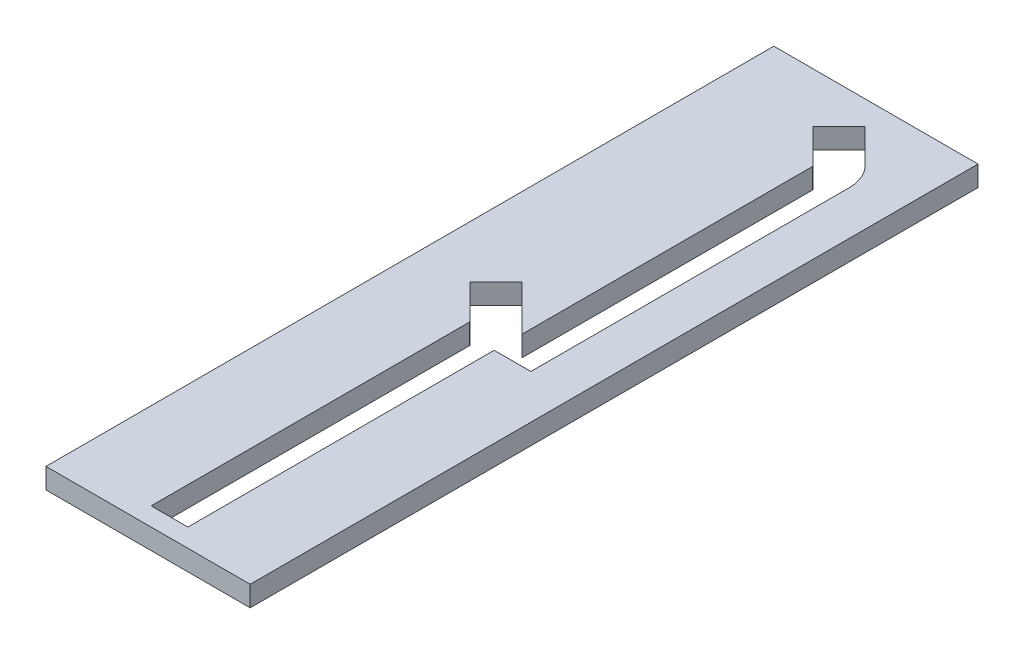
ISO-10303-21;
HEADER;
FILE_DESCRIPTION(('STEP AP214'),'2;1');
FILE_NAME('part.step','',(''),(''),'','','');
FILE_SCHEMA(('AUTOMOTIVE_DESIGN { 1 0 10303 214 1 1 1 1 }'));
ENDSEC;
DATA;
#1=APPLICATION_CONTEXT('core data for automotive mechanical design processes');
#2=APPLICATION_PROTOCOL_DEFINITION('international standard','automotive_design',2000,#1);
#3=PRODUCT_CONTEXT('',#1,'mechanical');
#4=PRODUCT('Part','Part','',(#3));
#5=PRODUCT_RELATED_PRODUCT_CATEGORY('part','',(#4));
#6=PRODUCT_DEFINITION_FORMATION('','',#4);
#7=PRODUCT_DEFINITION_CONTEXT('part definition',#1,'design');
#8=PRODUCT_DEFINITION('design','',#6,#7);
#9=PRODUCT_DEFINITION_SHAPE('','',#8);
#10=(LENGTH_UNIT() NAMED_UNIT(*) SI_UNIT(.MILLI.,.METRE.));
#11=(NAMED_UNIT(*) PLANE_ANGLE_UNIT() SI_UNIT($,.RADIAN.));
#12=(NAMED_UNIT(*) SI_UNIT($,.STERADIAN.) SOLID_ANGLE_UNIT());
#13=UNCERTAINTY_MEASURE_WITH_UNIT(LENGTH_MEASURE(1.E-05),#10,'distance_accuracy_value','');
#14=(GEOMETRIC_REPRESENTATION_CONTEXT(3) GLOBAL_UNCERTAINTY_ASSIGNED_CONTEXT((#13)) GLOBAL_UNIT_ASSIGNED_CONTEXT((#10,
#11,#12)) REPRESENTATION_CONTEXT('',''));
#15=CARTESIAN_POINT('',(0.,0.,0.));
#16=DIRECTION('',(0.,0.,1.));
#17=DIRECTION('',(1.,0.,0.));
#18=AXIS2_PLACEMENT_3D('',#15,#16,#17);
#19=CARTESIAN_POINT('',(0.,0.,0.));
#20=DIRECTION('',(0.,0.,1.));
#21=DIRECTION('',(1.,0.,0.));
#22=AXIS2_PLACEMENT_3D('',#19,#20,#21);
#23=PLANE('',#22);
#24=DIRECTION('',(1.,0.,0.));
#25=VECTOR('',#24,1.);
#26=CARTESIAN_POINT('',(-100.,-10.,0.));
#27=LINE('',#26,#25);
#28=CARTESIAN_POINT('',(-100.,-10.,0.));
#29=VERTEX_POINT('',#28);
#30=CARTESIAN_POINT('',(100.,-10.,0.));
#31=VERTEX_POINT('',#30);
#32=EDGE_CURVE('E9',#29,#31,#27,.T.);
#33=ORIENTED_EDGE('',*,*,#32,.T.);
#34=DIRECTION('',(0.,1.,0.));
#35=VECTOR('',#34,1.);
#36=CARTESIAN_POINT('',(100.,-10.,0.));
#37=LINE('',#36,#35);
#38=CARTESIAN_POINT('',(100.,10.,0.));
#39=VERTEX_POINT('',#38);
#40=EDGE_CURVE('E239',#31,#39,#37,.T.);
#41=ORIENTED_EDGE('',*,*,#40,.T.);
#42=DIRECTION('',(-1.,0.,0.));
#43=VECTOR('',#42,1.);
#44=CARTESIAN_POINT('',(100.,10.,0.));
#45=LINE('',#44,#43);
#46=CARTESIAN_POINT('',(-100.,10.,0.));
#47=VERTEX_POINT('',#46);
#48=EDGE_CURVE('E386',#39,#47,#45,.T.);
#49=ORIENTED_EDGE('',*,*,#48,.T.);
#50=DIRECTION('',(0.,-1.,0.));
#51=VECTOR('',#50,1.);
#52=CARTESIAN_POINT('',(-100.,10.,0.));
#53=LINE('',#52,#51);
#54=EDGE_CURVE('E391',#47,#29,#53,.T.);
#55=ORIENTED_EDGE('',*,*,#54,.T.);
#56=EDGE_LOOP('',(#33,#41,#49,#55));
#57=FACE_BOUND('',#56,.T.);
#58=ADVANCED_FACE('F15',(#57),#23,.T.);
#59=CARTESIAN_POINT('',(0.,0.,-713.));
#60=DIRECTION('',(0.,0.,1.));
#61=DIRECTION('',(1.,0.,0.));
#62=AXIS2_PLACEMENT_3D('',#59,#60,#61);
#63=PLANE('',#62);
#64=DIRECTION('',(0.,1.,0.));
#65=VECTOR('',#64,1.);
#66=CARTESIAN_POINT('',(100.,-10.,-713.));
#67=LINE('',#66,#65);
#68=CARTESIAN_POINT('',(100.,-10.,-713.));
#69=VERTEX_POINT('',#68);
#70=CARTESIAN_POINT('',(100.,10.,-713.));
#71=VERTEX_POINT('',#70);
#72=EDGE_CURVE('E198',#69,#71,#67,.T.);
#73=ORIENTED_EDGE('',*,*,#72,.F.);
#74=DIRECTION('',(1.,0.,0.));
#75=VECTOR('',#74,1.);
#76=CARTESIAN_POINT('',(-100.,-10.,-713.));
#77=LINE('',#76,#75);
#78=CARTESIAN_POINT('',(-100.,-10.,-713.));
#79=VERTEX_POINT('',#78);
#80=EDGE_CURVE('E23',#79,#69,#77,.T.);
#81=ORIENTED_EDGE('',*,*,#80,.F.);
#82=DIRECTION('',(0.,-1.,0.));
#83=VECTOR('',#82,1.);
#84=CARTESIAN_POINT('',(-100.,10.,-713.));
#85=LINE('',#84,#83);
#86=CARTESIAN_POINT('',(-100.,10.,-713.));
#87=VERTEX_POINT('',#86);
#88=EDGE_CURVE('E390',#87,#79,#85,.T.);
#89=ORIENTED_EDGE('',*,*,#88,.F.);
#90=DIRECTION('',(-1.,0.,0.));
#91=VECTOR('',#90,1.);
#92=CARTESIAN_POINT('',(100.,10.,-713.));
#93=LINE('',#92,#91);
#94=EDGE_CURVE('E238',#71,#87,#93,.T.);
#95=ORIENTED_EDGE('',*,*,#94,.F.);
#96=EDGE_LOOP('',(#73,#81,#89,#95));
#97=FACE_BOUND('',#96,.T.);
#98=ADVANCED_FACE('F408',(#97),#63,.F.);
#99=CARTESIAN_POINT('',(-100.,-10.,0.));
#100=DIRECTION('',(0.,-1.,0.));
#101=DIRECTION('',(0.,0.,-1.));
#102=AXIS2_PLACEMENT_3D('',#99,#100,#101);
#103=PLANE('',#102);
#104=CARTESIAN_POINT('',(19.,-10.,-629.715728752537));
#105=DIRECTION('',(0.,1.,0.));
#106=DIRECTION('',(-1.,0.,0.));
#107=AXIS2_PLACEMENT_3D('',#104,#105,#106);
#108=CIRCLE('',#107,38.);
#109=CARTESIAN_POINT('',(57.,-10.,-629.715728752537));
#110=VERTEX_POINT('',#109);
#111=CARTESIAN_POINT('',(45.8700576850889,-10.,-656.585786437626));
#112=VERTEX_POINT('',#111);
#113=EDGE_CURVE('E262',#110,#112,#108,.T.);
#114=ORIENTED_EDGE('',*,*,#113,.T.);
#115=DIRECTION('',(-0.707106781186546,0.,-0.707106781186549));
#116=VECTOR('',#115,1.);
#117=CARTESIAN_POINT('',(45.8700576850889,-10.,-656.585786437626));
#118=LINE('',#117,#116);
#119=CARTESIAN_POINT('',(12.8370490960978,-10.,-689.618795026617));
#120=VERTEX_POINT('',#119);
#121=EDGE_CURVE('E298',#112,#120,#118,.T.);
#122=ORIENTED_EDGE('',*,*,#121,.T.);
#123=DIRECTION('',(-0.707106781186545,0.,0.70710678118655));
#124=VECTOR('',#123,1.);
#125=CARTESIAN_POINT('',(12.8370490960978,-10.,-689.618795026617));
#126=LINE('',#125,#124);
#127=CARTESIAN_POINT('',(-12.6187950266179,-10.,-664.162950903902));
#128=VERTEX_POINT('',#127);
#129=EDGE_CURVE('E338',#120,#128,#126,.T.);
#130=ORIENTED_EDGE('',*,*,#129,.T.);
#131=DIRECTION('',(0.707106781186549,0.,0.707106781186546));
#132=VECTOR('',#131,1.);
#133=CARTESIAN_POINT('',(-12.6187950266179,-10.,-664.162950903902));
#134=LINE('',#133,#132);
#135=CARTESIAN_POINT('',(20.4142135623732,-10.,-631.12994231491));
#136=VERTEX_POINT('',#135);
#137=EDGE_CURVE('E276',#128,#136,#134,.T.);
#138=ORIENTED_EDGE('',*,*,#137,.T.);
#139=CARTESIAN_POINT('',(19.,-10.,-629.715728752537));
#140=DIRECTION('',(0.,-1.,0.));
#141=DIRECTION('',(1.,0.,0.));
#142=AXIS2_PLACEMENT_3D('',#139,#140,#141);
#143=CIRCLE('',#142,2.);
#144=CARTESIAN_POINT('',(21.,-10.,-629.715728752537));
#145=VERTEX_POINT('',#144);
#146=EDGE_CURVE('E330',#136,#145,#143,.T.);
#147=ORIENTED_EDGE('',*,*,#146,.T.);
#148=DIRECTION('',(0.,0.,1.));
#149=VECTOR('',#148,1.);
#150=CARTESIAN_POINT('',(21.,-10.,-629.715728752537));
#151=LINE('',#150,#149);
#152=CARTESIAN_POINT('',(21.,-10.,-345.455844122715));
#153=VERTEX_POINT('',#152);
#154=EDGE_CURVE('E356',#145,#153,#151,.T.);
#155=ORIENTED_EDGE('',*,*,#154,.T.);
#156=DIRECTION('',(-0.707106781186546,0.,-0.707106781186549));
#157=VECTOR('',#156,1.);
#158=CARTESIAN_POINT('',(21.,-10.,-345.455844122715));
#159=LINE('',#158,#157);
#160=CARTESIAN_POINT('',(-23.1629509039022,-10.,-389.618795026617));
#161=VERTEX_POINT('',#160);
#162=EDGE_CURVE('E367',#153,#161,#159,.T.);
#163=ORIENTED_EDGE('',*,*,#162,.T.);
#164=DIRECTION('',(-0.707106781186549,0.,0.707106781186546));
#165=VECTOR('',#164,1.);
#166=CARTESIAN_POINT('',(-23.1629509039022,-10.,-389.618795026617));
#167=LINE('',#166,#165);
#168=CARTESIAN_POINT('',(-48.618795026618,-10.,-364.162950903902));
#169=VERTEX_POINT('',#168);
#170=EDGE_CURVE('E199',#161,#169,#167,.T.);
#171=ORIENTED_EDGE('',*,*,#170,.T.);
#172=DIRECTION('',(0.707106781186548,0.,0.707106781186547));
#173=VECTOR('',#172,1.);
#174=CARTESIAN_POINT('',(-48.618795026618,-10.,-364.162950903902));
#175=LINE('',#174,#173);
#176=CARTESIAN_POINT('',(-15.5857864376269,-10.,-331.129942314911));
#177=VERTEX_POINT('',#176);
#178=EDGE_CURVE('E215',#169,#177,#175,.T.);
#179=ORIENTED_EDGE('',*,*,#178,.T.);
#180=CARTESIAN_POINT('',(-17.,-10.,-329.715728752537));
#181=DIRECTION('',(0.,-1.,0.));
#182=DIRECTION('',(1.,0.,0.));
#183=AXIS2_PLACEMENT_3D('',#180,#181,#182);
#184=CIRCLE('',#183,2.);
#185=CARTESIAN_POINT('',(-15.,-10.,-329.715728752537));
#186=VERTEX_POINT('',#185);
#187=EDGE_CURVE('E234',#177,#186,#184,.T.);
#188=ORIENTED_EDGE('',*,*,#187,.T.);
#189=DIRECTION('',(0.,0.,1.));
#190=VECTOR('',#189,1.);
#191=CARTESIAN_POINT('',(-15.,-10.,-329.715728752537));
#192=LINE('',#191,#190);
#193=CARTESIAN_POINT('',(-15.,-10.,-18.));
#194=VERTEX_POINT('',#193);
#195=EDGE_CURVE('E252',#186,#194,#192,.T.);
#196=ORIENTED_EDGE('',*,*,#195,.T.);
#197=DIRECTION('',(1.,0.,0.));
#198=VECTOR('',#197,1.);
#199=CARTESIAN_POINT('',(-15.,-10.,-18.));
#200=LINE('',#199,#198);
#201=CARTESIAN_POINT('',(21.,-10.,-18.));
#202=VERTEX_POINT('',#201);
#203=EDGE_CURVE('E261',#194,#202,#200,.T.);
#204=ORIENTED_EDGE('',*,*,#203,.T.);
#205=DIRECTION('',(0.,0.,-1.));
#206=VECTOR('',#205,1.);
#207=CARTESIAN_POINT('',(21.,-10.,-18.));
#208=LINE('',#207,#206);
#209=CARTESIAN_POINT('',(21.,-10.,-318.));
#210=VERTEX_POINT('',#209);
#211=EDGE_CURVE('E284',#202,#210,#208,.T.);
#212=ORIENTED_EDGE('',*,*,#211,.T.);
#213=DIRECTION('',(1.,0.,0.));
#214=VECTOR('',#213,1.);
#215=CARTESIAN_POINT('',(21.,-10.,-318.));
#216=LINE('',#215,#214);
#217=CARTESIAN_POINT('',(57.,-10.,-318.));
#218=VERTEX_POINT('',#217);
#219=EDGE_CURVE('E241',#210,#218,#216,.T.);
#220=ORIENTED_EDGE('',*,*,#219,.T.);
#221=DIRECTION('',(0.,0.,-1.));
#222=VECTOR('',#221,1.);
#223=CARTESIAN_POINT('',(57.,-10.,-318.));
#224=LINE('',#223,#222);
#225=EDGE_CURVE('E229',#218,#110,#224,.T.);
#226=ORIENTED_EDGE('',*,*,#225,.T.);
#227=EDGE_LOOP('',(#114,#122,#130,#138,#147,#155,#163,#171,#179,#188,#196,#204,#212,#220,#226));
#228=FACE_BOUND('',#227,.T.);
#229=ORIENTED_EDGE('',*,*,#80,.T.);
#230=DIRECTION('',(0.,0.,-1.));
#231=VECTOR('',#230,1.);
#232=CARTESIAN_POINT('',(100.,-10.,0.));
#233=LINE('',#232,#231);
#234=EDGE_CURVE('E235',#31,#69,#233,.T.);
#235=ORIENTED_EDGE('',*,*,#234,.F.);
#236=ORIENTED_EDGE('',*,*,#32,.F.);
#237=DIRECTION('',(0.,0.,-1.));
#238=VECTOR('',#237,1.);
#239=CARTESIAN_POINT('',(-100.,-10.,0.));
#240=LINE('',#239,#238);
#241=EDGE_CURVE('E394',#29,#79,#240,.T.);
#242=ORIENTED_EDGE('',*,*,#241,.T.);
#243=EDGE_LOOP('',(#229,#235,#236,#242));
#244=FACE_BOUND('',#243,.T.);
#245=ADVANCED_FACE('F402',(#228,#244),#103,.T.);
#246=CARTESIAN_POINT('',(-100.,10.,0.));
#247=DIRECTION('',(-1.,0.,0.));
#248=DIRECTION('',(0.,0.,1.));
#249=AXIS2_PLACEMENT_3D('',#246,#247,#248);
#250=PLANE('',#249);
#251=ORIENTED_EDGE('',*,*,#88,.T.);
#252=ORIENTED_EDGE('',*,*,#241,.F.);
#253=ORIENTED_EDGE('',*,*,#54,.F.);
#254=DIRECTION('',(0.,0.,-1.));
#255=VECTOR('',#254,1.);
#256=CARTESIAN_POINT('',(-100.,10.,0.));
#257=LINE('',#256,#255);
#258=EDGE_CURVE('E382',#47,#87,#257,.T.);
#259=ORIENTED_EDGE('',*,*,#258,.T.);
#260=EDGE_LOOP('',(#251,#252,#253,#259));
#261=FACE_BOUND('',#260,.T.);
#262=ADVANCED_FACE('F412',(#261),#250,.T.);
#263=CARTESIAN_POINT('',(100.,10.,0.));
#264=DIRECTION('',(0.,1.,0.));
#265=DIRECTION('',(1.,0.,0.));
#266=AXIS2_PLACEMENT_3D('',#263,#264,#265);
#267=PLANE('',#266);
#268=CARTESIAN_POINT('',(19.,10.,-629.715728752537));
#269=DIRECTION('',(0.,-1.,0.));
#270=DIRECTION('',(-1.,0.,0.));
#271=AXIS2_PLACEMENT_3D('',#268,#269,#270);
#272=CIRCLE('',#271,38.);
#273=CARTESIAN_POINT('',(45.8700576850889,10.,-656.585786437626));
#274=VERTEX_POINT('',#273);
#275=CARTESIAN_POINT('',(57.,10.,-629.715728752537));
#276=VERTEX_POINT('',#275);
#277=EDGE_CURVE('E266',#274,#276,#272,.T.);
#278=ORIENTED_EDGE('',*,*,#277,.T.);
#279=DIRECTION('',(0.,0.,1.));
#280=VECTOR('',#279,1.);
#281=CARTESIAN_POINT('',(57.,10.,-629.715728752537));
#282=LINE('',#281,#280);
#283=CARTESIAN_POINT('',(57.,10.,-318.));
#284=VERTEX_POINT('',#283);
#285=EDGE_CURVE('E304',#276,#284,#282,.T.);
#286=ORIENTED_EDGE('',*,*,#285,.T.);
#287=DIRECTION('',(-1.,0.,0.));
#288=VECTOR('',#287,1.);
#289=CARTESIAN_POINT('',(57.,10.,-318.));
#290=LINE('',#289,#288);
#291=CARTESIAN_POINT('',(21.,10.,-318.));
#292=VERTEX_POINT('',#291);
#293=EDGE_CURVE('E230',#284,#292,#290,.T.);
#294=ORIENTED_EDGE('',*,*,#293,.T.);
#295=DIRECTION('',(0.,0.,1.));
#296=VECTOR('',#295,1.);
#297=CARTESIAN_POINT('',(21.,10.,-318.));
#298=LINE('',#297,#296);
#299=CARTESIAN_POINT('',(21.,10.,-18.));
#300=VERTEX_POINT('',#299);
#301=EDGE_CURVE('E285',#292,#300,#298,.T.);
#302=ORIENTED_EDGE('',*,*,#301,.T.);
#303=DIRECTION('',(-1.,0.,0.));
#304=VECTOR('',#303,1.);
#305=CARTESIAN_POINT('',(21.,10.,-18.));
#306=LINE('',#305,#304);
#307=CARTESIAN_POINT('',(-15.,10.,-18.));
#308=VERTEX_POINT('',#307);
#309=EDGE_CURVE('E257',#300,#308,#306,.T.);
#310=ORIENTED_EDGE('',*,*,#309,.T.);
#311=DIRECTION('',(0.,0.,-1.));
#312=VECTOR('',#311,1.);
#313=CARTESIAN_POINT('',(-15.,10.,-18.));
#314=LINE('',#313,#312);
#315=CARTESIAN_POINT('',(-15.,10.,-329.715728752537));
#316=VERTEX_POINT('',#315);
#317=EDGE_CURVE('E256',#308,#316,#314,.T.);
#318=ORIENTED_EDGE('',*,*,#317,.T.);
#319=CARTESIAN_POINT('',(-17.,10.,-329.715728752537));
#320=DIRECTION('',(0.,1.,0.));
#321=DIRECTION('',(1.,0.,0.));
#322=AXIS2_PLACEMENT_3D('',#319,#320,#321);
#323=CIRCLE('',#322,2.);
#324=CARTESIAN_POINT('',(-15.5857864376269,10.,-331.129942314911));
#325=VERTEX_POINT('',#324);
#326=EDGE_CURVE('E206',#316,#325,#323,.T.);
#327=ORIENTED_EDGE('',*,*,#326,.T.);
#328=DIRECTION('',(-0.707106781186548,0.,-0.707106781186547));
#329=VECTOR('',#328,1.);
#330=CARTESIAN_POINT('',(-15.5857864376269,10.,-331.129942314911));
#331=LINE('',#330,#329);
#332=CARTESIAN_POINT('',(-48.618795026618,10.,-364.162950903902));
#333=VERTEX_POINT('',#332);
#334=EDGE_CURVE('E202',#325,#333,#331,.T.);
#335=ORIENTED_EDGE('',*,*,#334,.T.);
#336=DIRECTION('',(0.707106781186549,0.,-0.707106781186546));
#337=VECTOR('',#336,1.);
#338=CARTESIAN_POINT('',(-48.618795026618,10.,-364.162950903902));
#339=LINE('',#338,#337);
#340=CARTESIAN_POINT('',(-23.1629509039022,10.,-389.618795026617));
#341=VERTEX_POINT('',#340);
#342=EDGE_CURVE('E187',#333,#341,#339,.T.);
#343=ORIENTED_EDGE('',*,*,#342,.T.);
#344=DIRECTION('',(0.707106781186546,0.,0.707106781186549));
#345=VECTOR('',#344,1.);
#346=CARTESIAN_POINT('',(-23.1629509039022,10.,-389.618795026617));
#347=LINE('',#346,#345);
#348=CARTESIAN_POINT('',(21.,10.,-345.455844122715));
#349=VERTEX_POINT('',#348);
#350=EDGE_CURVE('E316',#341,#349,#347,.T.);
#351=ORIENTED_EDGE('',*,*,#350,.T.);
#352=DIRECTION('',(0.,0.,-1.));
#353=VECTOR('',#352,1.);
#354=CARTESIAN_POINT('',(21.,10.,-345.455844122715));
#355=LINE('',#354,#353);
#356=CARTESIAN_POINT('',(21.,10.,-629.715728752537));
#357=VERTEX_POINT('',#356);
#358=EDGE_CURVE('E360',#349,#357,#355,.T.);
#359=ORIENTED_EDGE('',*,*,#358,.T.);
#360=CARTESIAN_POINT('',(19.,10.,-629.715728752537));
#361=DIRECTION('',(0.,1.,0.));
#362=DIRECTION('',(1.,0.,0.));
#363=AXIS2_PLACEMENT_3D('',#360,#361,#362);
#364=CIRCLE('',#363,2.);
#365=CARTESIAN_POINT('',(20.4142135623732,10.,-631.12994231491));
#366=VERTEX_POINT('',#365);
#367=EDGE_CURVE('E334',#357,#366,#364,.T.);
#368=ORIENTED_EDGE('',*,*,#367,.T.);
#369=DIRECTION('',(-0.707106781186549,0.,-0.707106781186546));
#370=VECTOR('',#369,1.);
#371=CARTESIAN_POINT('',(20.4142135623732,10.,-631.12994231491));
#372=LINE('',#371,#370);
#373=CARTESIAN_POINT('',(-12.6187950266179,10.,-664.162950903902));
#374=VERTEX_POINT('',#373);
#375=EDGE_CURVE('E320',#366,#374,#372,.T.);
#376=ORIENTED_EDGE('',*,*,#375,.T.);
#377=DIRECTION('',(0.707106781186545,0.,-0.70710678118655));
#378=VECTOR('',#377,1.);
#379=CARTESIAN_POINT('',(-12.6187950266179,10.,-664.162950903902));
#380=LINE('',#379,#378);
#381=CARTESIAN_POINT('',(12.8370490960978,10.,-689.618795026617));
#382=VERTEX_POINT('',#381);
#383=EDGE_CURVE('E277',#374,#382,#380,.T.);
#384=ORIENTED_EDGE('',*,*,#383,.T.);
#385=DIRECTION('',(0.707106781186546,0.,0.707106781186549));
#386=VECTOR('',#385,1.);
#387=CARTESIAN_POINT('',(12.8370490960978,10.,-689.618795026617));
#388=LINE('',#387,#386);
#389=EDGE_CURVE('E294',#382,#274,#388,.T.);
#390=ORIENTED_EDGE('',*,*,#389,.T.);
#391=EDGE_LOOP('',(#278,#286,#294,#302,#310,#318,#327,#335,#343,#351,#359,#368,#376,#384,#390));
#392=FACE_BOUND('',#391,.T.);
#393=ORIENTED_EDGE('',*,*,#94,.T.);
#394=ORIENTED_EDGE('',*,*,#258,.F.);
#395=ORIENTED_EDGE('',*,*,#48,.F.);
#396=DIRECTION('',(0.,0.,-1.));
#397=VECTOR('',#396,1.);
#398=CARTESIAN_POINT('',(100.,10.,0.));
#399=LINE('',#398,#397);
#400=EDGE_CURVE('E305',#39,#71,#399,.T.);
#401=ORIENTED_EDGE('',*,*,#400,.T.);
#402=EDGE_LOOP('',(#393,#394,#395,#401));
#403=FACE_BOUND('',#402,.T.);
#404=ADVANCED_FACE('F203',(#392,#403),#267,.T.);
#405=CARTESIAN_POINT('',(100.,-10.,0.));
#406=DIRECTION('',(1.,0.,0.));
#407=DIRECTION('',(0.,1.,0.));
#408=AXIS2_PLACEMENT_3D('',#405,#406,#407);
#409=PLANE('',#408);
#410=ORIENTED_EDGE('',*,*,#72,.T.);
#411=ORIENTED_EDGE('',*,*,#400,.F.);
#412=ORIENTED_EDGE('',*,*,#40,.F.);
#413=ORIENTED_EDGE('',*,*,#234,.T.);
#414=EDGE_LOOP('',(#410,#411,#412,#413));
#415=FACE_BOUND('',#414,.T.);
#416=ADVANCED_FACE('F406',(#415),#409,.T.);
#417=CARTESIAN_POINT('',(-23.1629509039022,10.,-389.618795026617));
#418=DIRECTION('',(-0.707106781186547,0.,-0.707106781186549));
#419=DIRECTION('',(-0.707106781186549,0.,0.707106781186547));
#420=AXIS2_PLACEMENT_3D('',#417,#418,#419);
#421=PLANE('',#420);
#422=ORIENTED_EDGE('',*,*,#170,.F.);
#423=DIRECTION('',(0.,-1.,0.));
#424=VECTOR('',#423,1.);
#425=CARTESIAN_POINT('',(-23.1629509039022,10.,-389.618795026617));
#426=LINE('',#425,#424);
#427=EDGE_CURVE('E194',#341,#161,#426,.T.);
#428=ORIENTED_EDGE('',*,*,#427,.F.);
#429=ORIENTED_EDGE('',*,*,#342,.F.);
#430=DIRECTION('',(0.,-1.,0.));
#431=VECTOR('',#430,1.);
#432=CARTESIAN_POINT('',(-48.618795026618,10.,-364.162950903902));
#433=LINE('',#432,#431);
#434=EDGE_CURVE('E191',#333,#169,#433,.T.);
#435=ORIENTED_EDGE('',*,*,#434,.T.);
#436=EDGE_LOOP('',(#422,#428,#429,#435));
#437=FACE_BOUND('',#436,.T.);
#438=ADVANCED_FACE('F189',(#437),#421,.F.);
#439=CARTESIAN_POINT('',(21.,10.,-345.455844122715));
#440=DIRECTION('',(0.707106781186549,0.,-0.707106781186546));
#441=DIRECTION('',(0.,-1.,0.));
#442=AXIS2_PLACEMENT_3D('',#439,#440,#441);
#443=PLANE('',#442);
#444=ORIENTED_EDGE('',*,*,#162,.F.);
#445=DIRECTION('',(0.,-1.,0.));
#446=VECTOR('',#445,1.);
#447=CARTESIAN_POINT('',(21.,10.,-345.455844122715));
#448=LINE('',#447,#446);
#449=EDGE_CURVE('E363',#349,#153,#448,.T.);
#450=ORIENTED_EDGE('',*,*,#449,.F.);
#451=ORIENTED_EDGE('',*,*,#350,.F.);
#452=ORIENTED_EDGE('',*,*,#427,.T.);
#453=EDGE_LOOP('',(#444,#450,#451,#452));
#454=FACE_BOUND('',#453,.T.);
#455=ADVANCED_FACE('F472',(#454),#443,.F.);
#456=CARTESIAN_POINT('',(21.,10.,-629.715728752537));
#457=DIRECTION('',(-1.,0.,0.));
#458=DIRECTION('',(0.,0.,1.));
#459=AXIS2_PLACEMENT_3D('',#456,#457,#458);
#460=PLANE('',#459);
#461=ORIENTED_EDGE('',*,*,#154,.F.);
#462=DIRECTION('',(0.,-1.,0.));
#463=VECTOR('',#462,1.);
#464=CARTESIAN_POINT('',(21.,10.,-629.715728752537));
#465=LINE('',#464,#463);
#466=EDGE_CURVE('E341',#357,#145,#465,.T.);
#467=ORIENTED_EDGE('',*,*,#466,.F.);
#468=ORIENTED_EDGE('',*,*,#358,.F.);
#469=ORIENTED_EDGE('',*,*,#449,.T.);
#470=EDGE_LOOP('',(#461,#467,#468,#469));
#471=FACE_BOUND('',#470,.T.);
#472=ADVANCED_FACE('F483',(#471),#460,.F.);
#473=CARTESIAN_POINT('',(19.,10.,-629.715728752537));
#474=DIRECTION('',(0.,-1.,0.));
#475=DIRECTION('',(1.,0.,0.));
#476=AXIS2_PLACEMENT_3D('',#473,#474,#475);
#477=CYLINDRICAL_SURFACE('',#476,2.);
#478=ORIENTED_EDGE('',*,*,#146,.F.);
#479=DIRECTION('',(0.,-1.,0.));
#480=VECTOR('',#479,1.);
#481=CARTESIAN_POINT('',(20.4142135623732,10.,-631.12994231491));
#482=LINE('',#481,#480);
#483=EDGE_CURVE('E323',#366,#136,#482,.T.);
#484=ORIENTED_EDGE('',*,*,#483,.F.);
#485=ORIENTED_EDGE('',*,*,#367,.F.);
#486=ORIENTED_EDGE('',*,*,#466,.T.);
#487=EDGE_LOOP('',(#478,#484,#485,#486));
#488=FACE_BOUND('',#487,.T.);
#489=ADVANCED_FACE('F495',(#488),#477,.T.);
#490=CARTESIAN_POINT('',(-12.6187950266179,10.,-664.162950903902));
#491=DIRECTION('',(-0.707106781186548,0.,0.707106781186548));
#492=DIRECTION('',(0.,1.,0.));
#493=AXIS2_PLACEMENT_3D('',#490,#491,#492);
#494=PLANE('',#493);
#495=ORIENTED_EDGE('',*,*,#137,.F.);
#496=DIRECTION('',(0.,-1.,0.));
#497=VECTOR('',#496,1.);
#498=CARTESIAN_POINT('',(-12.6187950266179,10.,-664.162950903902));
#499=LINE('',#498,#497);
#500=EDGE_CURVE('E272',#374,#128,#499,.T.);
#501=ORIENTED_EDGE('',*,*,#500,.F.);
#502=ORIENTED_EDGE('',*,*,#375,.F.);
#503=ORIENTED_EDGE('',*,*,#483,.T.);
#504=EDGE_LOOP('',(#495,#501,#502,#503));
#505=FACE_BOUND('',#504,.T.);
#506=ADVANCED_FACE('F507',(#505),#494,.F.);
#507=CARTESIAN_POINT('',(12.8370490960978,10.,-689.618795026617));
#508=DIRECTION('',(-0.707106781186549,0.,-0.707106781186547));
#509=DIRECTION('',(-0.707106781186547,0.,0.707106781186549));
#510=AXIS2_PLACEMENT_3D('',#507,#508,#509);
#511=PLANE('',#510);
#512=ORIENTED_EDGE('',*,*,#129,.F.);
#513=DIRECTION('',(0.,-1.,0.));
#514=VECTOR('',#513,1.);
#515=CARTESIAN_POINT('',(12.8370490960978,10.,-689.618795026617));
#516=LINE('',#515,#514);
#517=EDGE_CURVE('E297',#382,#120,#516,.T.);
#518=ORIENTED_EDGE('',*,*,#517,.F.);
#519=ORIENTED_EDGE('',*,*,#383,.F.);
#520=ORIENTED_EDGE('',*,*,#500,.T.);
#521=EDGE_LOOP('',(#512,#518,#519,#520));
#522=FACE_BOUND('',#521,.T.);
#523=ADVANCED_FACE('F518',(#522),#511,.F.);
#524=CARTESIAN_POINT('',(45.8700576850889,10.,-656.585786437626));
#525=DIRECTION('',(0.707106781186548,0.,-0.707106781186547));
#526=DIRECTION('',(0.,-1.,0.));
#527=AXIS2_PLACEMENT_3D('',#524,#525,#526);
#528=PLANE('',#527);
#529=ORIENTED_EDGE('',*,*,#121,.F.);
#530=DIRECTION('',(0.,-1.,0.));
#531=VECTOR('',#530,1.);
#532=CARTESIAN_POINT('',(45.8700576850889,10.,-656.585786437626));
#533=LINE('',#532,#531);
#534=EDGE_CURVE('E319',#274,#112,#533,.T.);
#535=ORIENTED_EDGE('',*,*,#534,.F.);
#536=ORIENTED_EDGE('',*,*,#389,.F.);
#537=ORIENTED_EDGE('',*,*,#517,.T.);
#538=EDGE_LOOP('',(#529,#535,#536,#537));
#539=FACE_BOUND('',#538,.T.);
#540=ADVANCED_FACE('F530',(#539),#528,.F.);
#541=CARTESIAN_POINT('',(19.,10.,-629.715728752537));
#542=DIRECTION('',(0.,-1.,0.));
#543=DIRECTION('',(-1.,0.,0.));
#544=AXIS2_PLACEMENT_3D('',#541,#542,#543);
#545=CYLINDRICAL_SURFACE('',#544,38.);
#546=ORIENTED_EDGE('',*,*,#113,.F.);
#547=DIRECTION('',(0.,-1.,0.));
#548=VECTOR('',#547,1.);
#549=CARTESIAN_POINT('',(57.,10.,-629.715728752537));
#550=LINE('',#549,#548);
#551=EDGE_CURVE('E267',#276,#110,#550,.T.);
#552=ORIENTED_EDGE('',*,*,#551,.F.);
#553=ORIENTED_EDGE('',*,*,#277,.F.);
#554=ORIENTED_EDGE('',*,*,#534,.T.);
#555=EDGE_LOOP('',(#546,#552,#553,#554));
#556=FACE_BOUND('',#555,.T.);
#557=ADVANCED_FACE('F540',(#556),#545,.F.);
#558=CARTESIAN_POINT('',(57.,10.,-318.));
#559=DIRECTION('',(1.,0.,0.));
#560=DIRECTION('',(0.,1.,0.));
#561=AXIS2_PLACEMENT_3D('',#558,#559,#560);
#562=PLANE('',#561);
#563=ORIENTED_EDGE('',*,*,#225,.F.);
#564=DIRECTION('',(0.,-1.,0.));
#565=VECTOR('',#564,1.);
#566=CARTESIAN_POINT('',(57.,10.,-318.));
#567=LINE('',#566,#565);
#568=EDGE_CURVE('E225',#284,#218,#567,.T.);
#569=ORIENTED_EDGE('',*,*,#568,.F.);
#570=ORIENTED_EDGE('',*,*,#285,.F.);
#571=ORIENTED_EDGE('',*,*,#551,.T.);
#572=EDGE_LOOP('',(#563,#569,#570,#571));
#573=FACE_BOUND('',#572,.T.);
#574=ADVANCED_FACE('F550',(#573),#562,.F.);
#575=CARTESIAN_POINT('',(21.,10.,-318.));
#576=DIRECTION('',(0.,0.,1.));
#577=DIRECTION('',(1.,0.,0.));
#578=AXIS2_PLACEMENT_3D('',#575,#576,#577);
#579=PLANE('',#578);
#580=ORIENTED_EDGE('',*,*,#219,.F.);
#581=DIRECTION('',(0.,-1.,0.));
#582=VECTOR('',#581,1.);
#583=CARTESIAN_POINT('',(21.,10.,-318.));
#584=LINE('',#583,#582);
#585=EDGE_CURVE('E245',#292,#210,#584,.T.);
#586=ORIENTED_EDGE('',*,*,#585,.F.);
#587=ORIENTED_EDGE('',*,*,#293,.F.);
#588=ORIENTED_EDGE('',*,*,#568,.T.);
#589=EDGE_LOOP('',(#580,#586,#587,#588));
#590=FACE_BOUND('',#589,.T.);
#591=ADVANCED_FACE('F560',(#590),#579,.F.);
#592=CARTESIAN_POINT('',(21.,10.,-18.));
#593=DIRECTION('',(1.,0.,0.));
#594=DIRECTION('',(0.,1.,0.));
#595=AXIS2_PLACEMENT_3D('',#592,#593,#594);
#596=PLANE('',#595);
#597=ORIENTED_EDGE('',*,*,#211,.F.);
#598=DIRECTION('',(0.,-1.,0.));
#599=VECTOR('',#598,1.);
#600=CARTESIAN_POINT('',(21.,10.,-18.));
#601=LINE('',#600,#599);
#602=EDGE_CURVE('E260',#300,#202,#601,.T.);
#603=ORIENTED_EDGE('',*,*,#602,.F.);
#604=ORIENTED_EDGE('',*,*,#301,.F.);
#605=ORIENTED_EDGE('',*,*,#585,.T.);
#606=EDGE_LOOP('',(#597,#603,#604,#605));
#607=FACE_BOUND('',#606,.T.);
#608=ADVANCED_FACE('F571',(#607),#596,.F.);
#609=CARTESIAN_POINT('',(-15.,10.,-18.));
#610=DIRECTION('',(0.,0.,1.));
#611=DIRECTION('',(1.,0.,0.));
#612=AXIS2_PLACEMENT_3D('',#609,#610,#611);
#613=PLANE('',#612);
#614=ORIENTED_EDGE('',*,*,#203,.F.);
#615=DIRECTION('',(0.,-1.,0.));
#616=VECTOR('',#615,1.);
#617=CARTESIAN_POINT('',(-15.,10.,-18.));
#618=LINE('',#617,#616);
#619=EDGE_CURVE('E268',#308,#194,#618,.T.);
#620=ORIENTED_EDGE('',*,*,#619,.F.);
#621=ORIENTED_EDGE('',*,*,#309,.F.);
#622=ORIENTED_EDGE('',*,*,#602,.T.);
#623=EDGE_LOOP('',(#614,#620,#621,#622));
#624=FACE_BOUND('',#623,.T.);
#625=ADVANCED_FACE('F581',(#624),#613,.F.);
#626=CARTESIAN_POINT('',(-15.,10.,-329.715728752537));
#627=DIRECTION('',(-1.,0.,0.));
#628=DIRECTION('',(0.,0.,1.));
#629=AXIS2_PLACEMENT_3D('',#626,#627,#628);
#630=PLANE('',#629);
#631=ORIENTED_EDGE('',*,*,#195,.F.);
#632=DIRECTION('',(0.,-1.,0.));
#633=VECTOR('',#632,1.);
#634=CARTESIAN_POINT('',(-15.,10.,-329.715728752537));
#635=LINE('',#634,#633);
#636=EDGE_CURVE('E233',#316,#186,#635,.T.);
#637=ORIENTED_EDGE('',*,*,#636,.F.);
#638=ORIENTED_EDGE('',*,*,#317,.F.);
#639=ORIENTED_EDGE('',*,*,#619,.T.);
#640=EDGE_LOOP('',(#631,#637,#638,#639));
#641=FACE_BOUND('',#640,.T.);
#642=ADVANCED_FACE('F592',(#641),#630,.F.);
#643=CARTESIAN_POINT('',(-17.,10.,-329.715728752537));
#644=DIRECTION('',(0.,-1.,0.));
#645=DIRECTION('',(1.,0.,0.));
#646=AXIS2_PLACEMENT_3D('',#643,#644,#645);
#647=CYLINDRICAL_SURFACE('',#646,2.);
#648=ORIENTED_EDGE('',*,*,#187,.F.);
#649=DIRECTION('',(0.,-1.,0.));
#650=VECTOR('',#649,1.);
#651=CARTESIAN_POINT('',(-15.5857864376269,10.,-331.129942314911));
#652=LINE('',#651,#650);
#653=EDGE_CURVE('E211',#325,#177,#652,.T.);
#654=ORIENTED_EDGE('',*,*,#653,.F.);
#655=ORIENTED_EDGE('',*,*,#326,.F.);
#656=ORIENTED_EDGE('',*,*,#636,.T.);
#657=EDGE_LOOP('',(#648,#654,#655,#656));
#658=FACE_BOUND('',#657,.T.);
#659=ADVANCED_FACE('F603',(#658),#647,.T.);
#660=CARTESIAN_POINT('',(-48.618795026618,10.,-364.162950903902));
#661=DIRECTION('',(-0.707106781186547,0.,0.707106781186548));
#662=DIRECTION('',(0.,1.,0.));
#663=AXIS2_PLACEMENT_3D('',#660,#661,#662);
#664=PLANE('',#663);
#665=ORIENTED_EDGE('',*,*,#178,.F.);
#666=ORIENTED_EDGE('',*,*,#434,.F.);
#667=ORIENTED_EDGE('',*,*,#334,.F.);
#668=ORIENTED_EDGE('',*,*,#653,.T.);
#669=EDGE_LOOP('',(#665,#666,#667,#668));
#670=FACE_BOUND('',#669,.T.);
#671=ADVANCED_FACE('F213',(#670),#664,.F.);
#672=CLOSED_SHELL('',(#58,#98,#245,#262,#404,#416,#438,#455,#472,#489,#506,#523,#540,#557,#574,
#591,#608,#625,#642,#659,#671));
#673=MANIFOLD_SOLID_BREP('B1',#672);
#674=ADVANCED_BREP_SHAPE_REPRESENTATION('',(#18,#673),#14);
#675=SHAPE_DEFINITION_REPRESENTATION(#9,#674);
ENDSEC;
END-ISO-10303-21;
